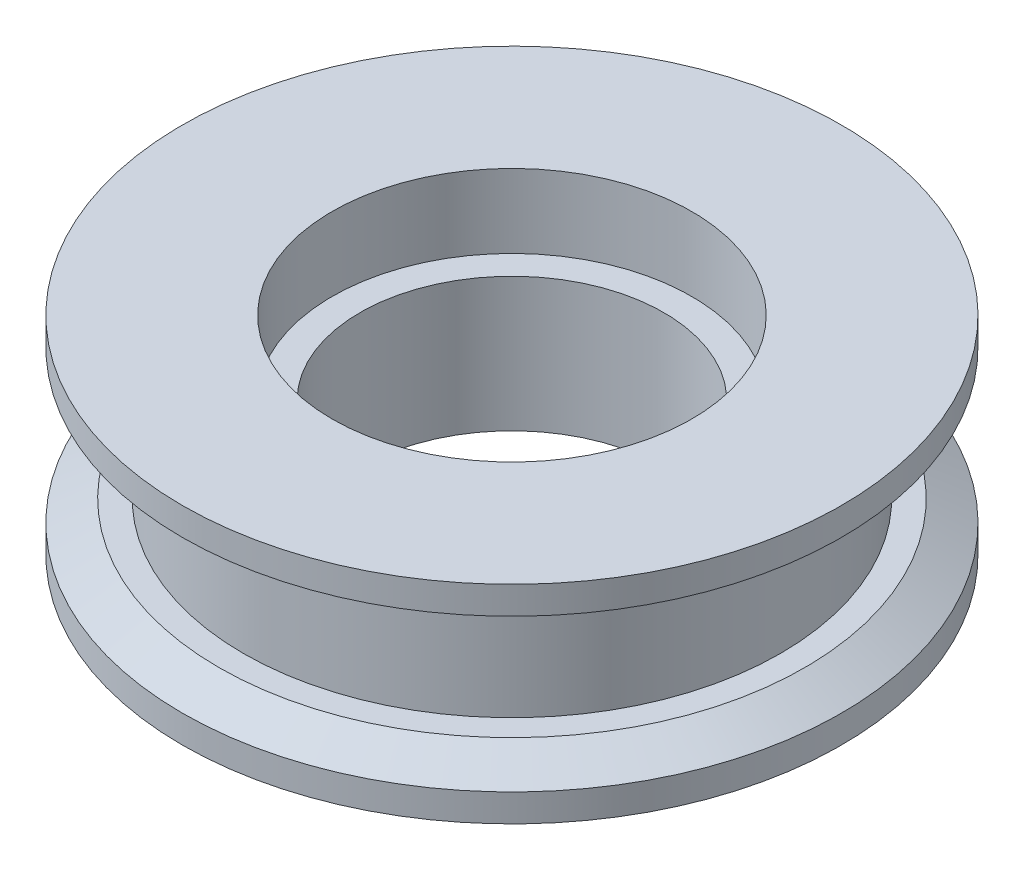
ISO-10303-21;
HEADER;
FILE_DESCRIPTION(('STEP AP214'),'2;1');
FILE_NAME('part.step','',(''),(''),'','','');
FILE_SCHEMA(('AUTOMOTIVE_DESIGN { 1 0 10303 214 1 1 1 1 }'));
ENDSEC;
DATA;
#1=APPLICATION_CONTEXT('core data for automotive mechanical design processes');
#2=APPLICATION_PROTOCOL_DEFINITION('international standard','automotive_design',2000,#1);
#3=PRODUCT_CONTEXT('',#1,'mechanical');
#4=PRODUCT('Part','Part','',(#3));
#5=PRODUCT_RELATED_PRODUCT_CATEGORY('part','',(#4));
#6=PRODUCT_DEFINITION_FORMATION('','',#4);
#7=PRODUCT_DEFINITION_CONTEXT('part definition',#1,'design');
#8=PRODUCT_DEFINITION('design','',#6,#7);
#9=PRODUCT_DEFINITION_SHAPE('','',#8);
#10=(LENGTH_UNIT() NAMED_UNIT(*) SI_UNIT(.MILLI.,.METRE.));
#11=(NAMED_UNIT(*) PLANE_ANGLE_UNIT() SI_UNIT($,.RADIAN.));
#12=(NAMED_UNIT(*) SI_UNIT($,.STERADIAN.) SOLID_ANGLE_UNIT());
#13=UNCERTAINTY_MEASURE_WITH_UNIT(LENGTH_MEASURE(1.E-05),#10,'distance_accuracy_value','');
#14=(GEOMETRIC_REPRESENTATION_CONTEXT(3) GLOBAL_UNCERTAINTY_ASSIGNED_CONTEXT((#13)) GLOBAL_UNIT_ASSIGNED_CONTEXT((#10,
#11,#12)) REPRESENTATION_CONTEXT('',''));
#15=CARTESIAN_POINT('',(0.,0.,0.));
#16=DIRECTION('',(0.,0.,1.));
#17=DIRECTION('',(1.,0.,0.));
#18=AXIS2_PLACEMENT_3D('',#15,#16,#17);
#19=CARTESIAN_POINT('',(409.,-812.8,-284.));
#20=DIRECTION('',(0.,1.,0.));
#21=DIRECTION('',(0.,0.,1.));
#22=AXIS2_PLACEMENT_3D('',#19,#20,#21);
#23=CYLINDRICAL_SURFACE('',#22,6.22299999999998);
#24=CARTESIAN_POINT('',(409.,8.00000000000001,-284.));
#25=DIRECTION('',(0.,1.,0.));
#26=DIRECTION('',(0.,0.,1.));
#27=AXIS2_PLACEMENT_3D('',#24,#25,#26);
#28=CIRCLE('',#27,6.22299999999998);
#29=CARTESIAN_POINT('',(409.,8.00000000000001,-277.777));
#30=VERTEX_POINT('',#29);
#31=EDGE_CURVE('E60',#30,#30,#28,.T.);
#32=ORIENTED_EDGE('',*,*,#31,.F.);
#33=EDGE_LOOP('',(#32));
#34=FACE_BOUND('',#33,.T.);
#35=CARTESIAN_POINT('',(409.,13.4840000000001,-284.));
#36=DIRECTION('',(0.,1.,0.));
#37=DIRECTION('',(0.,0.,1.));
#38=AXIS2_PLACEMENT_3D('',#35,#36,#37);
#39=CIRCLE('',#38,6.22299999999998);
#40=CARTESIAN_POINT('',(409.,13.4840000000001,-277.777));
#41=VERTEX_POINT('',#40);
#42=EDGE_CURVE('E32',#41,#41,#39,.F.);
#43=ORIENTED_EDGE('',*,*,#42,.F.);
#44=EDGE_LOOP('',(#43));
#45=FACE_BOUND('',#44,.T.);
#46=ADVANCED_FACE('F28',(#34,#45),#23,.F.);
#47=CARTESIAN_POINT('',(409.,10.,-284.));
#48=DIRECTION('',(0.,1.,0.));
#49=DIRECTION('',(0.,0.,1.));
#50=AXIS2_PLACEMENT_3D('',#47,#48,#49);
#51=PLANE('',#50);
#52=CARTESIAN_POINT('',(409.,10.,-284.));
#53=DIRECTION('',(0.,1.,0.));
#54=DIRECTION('',(0.,0.,1.));
#55=AXIS2_PLACEMENT_3D('',#52,#53,#54);
#56=CIRCLE('',#55,12.);
#57=CARTESIAN_POINT('',(409.,10.,-272.));
#58=VERTEX_POINT('',#57);
#59=EDGE_CURVE('E45',#58,#58,#56,.T.);
#60=ORIENTED_EDGE('',*,*,#59,.T.);
#61=EDGE_LOOP('',(#60));
#62=FACE_BOUND('',#61,.T.);
#63=CARTESIAN_POINT('',(409.,10.,-284.));
#64=DIRECTION('',(0.,1.,0.));
#65=DIRECTION('',(0.,0.,1.));
#66=AXIS2_PLACEMENT_3D('',#63,#64,#65);
#67=CIRCLE('',#66,11.);
#68=CARTESIAN_POINT('',(409.,10.,-273.));
#69=VERTEX_POINT('',#68);
#70=EDGE_CURVE('E52',#69,#69,#67,.T.);
#71=ORIENTED_EDGE('',*,*,#70,.F.);
#72=EDGE_LOOP('',(#71));
#73=FACE_BOUND('',#72,.T.);
#74=ADVANCED_FACE('F92',(#62,#73),#51,.T.);
#75=CARTESIAN_POINT('',(409.,10.,-284.));
#76=DIRECTION('',(0.,-1.,0.));
#77=DIRECTION('',(0.,0.,-1.));
#78=AXIS2_PLACEMENT_3D('',#75,#76,#77);
#79=CYLINDRICAL_SURFACE('',#78,13.5);
#80=CARTESIAN_POINT('',(409.,9.13397459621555,-284.));
#81=DIRECTION('',(0.,1.,0.));
#82=DIRECTION('',(0.,0.,1.));
#83=AXIS2_PLACEMENT_3D('',#80,#81,#82);
#84=CIRCLE('',#83,13.5);
#85=CARTESIAN_POINT('',(409.,9.13397459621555,-270.5));
#86=VERTEX_POINT('',#85);
#87=EDGE_CURVE('E40',#86,#86,#84,.F.);
#88=ORIENTED_EDGE('',*,*,#87,.T.);
#89=EDGE_LOOP('',(#88));
#90=FACE_BOUND('',#89,.T.);
#91=CARTESIAN_POINT('',(409.,8.,-284.));
#92=DIRECTION('',(0.,1.,0.));
#93=DIRECTION('',(0.,0.,1.));
#94=AXIS2_PLACEMENT_3D('',#91,#92,#93);
#95=CIRCLE('',#94,13.5);
#96=CARTESIAN_POINT('',(409.,8.,-270.5));
#97=VERTEX_POINT('',#96);
#98=EDGE_CURVE('E48',#97,#97,#95,.T.);
#99=ORIENTED_EDGE('',*,*,#98,.T.);
#100=EDGE_LOOP('',(#99));
#101=FACE_BOUND('',#100,.T.);
#102=ADVANCED_FACE('F99',(#90,#101),#79,.T.);
#103=CARTESIAN_POINT('',(409.,8.,-284.));
#104=DIRECTION('',(0.,1.,0.));
#105=DIRECTION('',(0.,0.,1.));
#106=AXIS2_PLACEMENT_3D('',#103,#104,#105);
#107=PLANE('',#106);
#108=ORIENTED_EDGE('',*,*,#31,.T.);
#109=EDGE_LOOP('',(#108));
#110=FACE_BOUND('',#109,.T.);
#111=ORIENTED_EDGE('',*,*,#98,.F.);
#112=EDGE_LOOP('',(#111));
#113=FACE_BOUND('',#112,.T.);
#114=ADVANCED_FACE('F135',(#110,#113),#107,.F.);
#115=CARTESIAN_POINT('',(409.,14.5,-284.));
#116=DIRECTION('',(0.,-1.,0.));
#117=DIRECTION('',(0.,0.,-1.));
#118=AXIS2_PLACEMENT_3D('',#115,#116,#117);
#119=CYLINDRICAL_SURFACE('',#118,11.);
#120=CARTESIAN_POINT('',(409.,14.5,-284.));
#121=DIRECTION('',(0.,1.,0.));
#122=DIRECTION('',(0.,0.,1.));
#123=AXIS2_PLACEMENT_3D('',#120,#121,#122);
#124=CIRCLE('',#123,11.);
#125=CARTESIAN_POINT('',(409.,14.5,-273.));
#126=VERTEX_POINT('',#125);
#127=EDGE_CURVE('E51',#126,#126,#124,.T.);
#128=ORIENTED_EDGE('',*,*,#127,.F.);
#129=EDGE_LOOP('',(#128));
#130=FACE_BOUND('',#129,.T.);
#131=ORIENTED_EDGE('',*,*,#70,.T.);
#132=EDGE_LOOP('',(#131));
#133=FACE_BOUND('',#132,.T.);
#134=ADVANCED_FACE('F88',(#130,#133),#119,.T.);
#135=CARTESIAN_POINT('',(409.,14.5,-284.));
#136=DIRECTION('',(0.,1.,0.));
#137=DIRECTION('',(0.,0.,1.));
#138=AXIS2_PLACEMENT_3D('',#135,#136,#137);
#139=PLANE('',#138);
#140=CARTESIAN_POINT('',(409.,14.5,-284.));
#141=DIRECTION('',(0.,1.,0.));
#142=DIRECTION('',(0.,0.,1.));
#143=AXIS2_PLACEMENT_3D('',#140,#141,#142);
#144=CIRCLE('',#143,12.);
#145=CARTESIAN_POINT('',(409.,14.5,-272.));
#146=VERTEX_POINT('',#145);
#147=EDGE_CURVE('E10',#146,#146,#144,.F.);
#148=ORIENTED_EDGE('',*,*,#147,.T.);
#149=EDGE_LOOP('',(#148));
#150=FACE_BOUND('',#149,.T.);
#151=ORIENTED_EDGE('',*,*,#127,.T.);
#152=EDGE_LOOP('',(#151));
#153=FACE_BOUND('',#152,.T.);
#154=ADVANCED_FACE('F81',(#150,#153),#139,.F.);
#155=CARTESIAN_POINT('',(409.,16.5,-284.));
#156=DIRECTION('',(0.,-1.,0.));
#157=DIRECTION('',(0.,0.,-1.));
#158=AXIS2_PLACEMENT_3D('',#155,#156,#157);
#159=CYLINDRICAL_SURFACE('',#158,13.5);
#160=CARTESIAN_POINT('',(409.,15.3660254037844,-284.));
#161=DIRECTION('',(0.,1.,0.));
#162=DIRECTION('',(0.,0.,1.));
#163=AXIS2_PLACEMENT_3D('',#160,#161,#162);
#164=CIRCLE('',#163,13.5);
#165=CARTESIAN_POINT('',(409.,15.3660254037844,-270.5));
#166=VERTEX_POINT('',#165);
#167=EDGE_CURVE('E36',#166,#166,#164,.T.);
#168=ORIENTED_EDGE('',*,*,#167,.T.);
#169=EDGE_LOOP('',(#168));
#170=FACE_BOUND('',#169,.T.);
#171=CARTESIAN_POINT('',(409.,16.5,-284.));
#172=DIRECTION('',(0.,1.,0.));
#173=DIRECTION('',(0.,0.,1.));
#174=AXIS2_PLACEMENT_3D('',#171,#172,#173);
#175=CIRCLE('',#174,13.5);
#176=CARTESIAN_POINT('',(409.,16.5,-270.5));
#177=VERTEX_POINT('',#176);
#178=EDGE_CURVE('E55',#177,#177,#175,.T.);
#179=ORIENTED_EDGE('',*,*,#178,.F.);
#180=EDGE_LOOP('',(#179));
#181=FACE_BOUND('',#180,.T.);
#182=ADVANCED_FACE('F76',(#170,#181),#159,.T.);
#183=CARTESIAN_POINT('',(409.,16.5,-284.));
#184=DIRECTION('',(0.,1.,0.));
#185=DIRECTION('',(0.,0.,1.));
#186=AXIS2_PLACEMENT_3D('',#183,#184,#185);
#187=PLANE('',#186);
#188=CARTESIAN_POINT('',(409.,16.5,-284.));
#189=DIRECTION('',(0.,1.,0.));
#190=DIRECTION('',(0.,0.,1.));
#191=AXIS2_PLACEMENT_3D('',#188,#189,#190);
#192=CIRCLE('',#191,7.36599999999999);
#193=CARTESIAN_POINT('',(409.,16.5,-276.634));
#194=VERTEX_POINT('',#193);
#195=EDGE_CURVE('E66',#194,#194,#192,.T.);
#196=ORIENTED_EDGE('',*,*,#195,.F.);
#197=EDGE_LOOP('',(#196));
#198=FACE_BOUND('',#197,.T.);
#199=ORIENTED_EDGE('',*,*,#178,.T.);
#200=EDGE_LOOP('',(#199));
#201=FACE_BOUND('',#200,.T.);
#202=ADVANCED_FACE('F72',(#198,#201),#187,.T.);
#203=CARTESIAN_POINT('',(409.,10.,-284.));
#204=DIRECTION('',(0.,-1.,0.));
#205=DIRECTION('',(0.,0.,-1.));
#206=AXIS2_PLACEMENT_3D('',#203,#204,#205);
#207=CONICAL_SURFACE('',#206,12.,1.04719755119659);
#208=ORIENTED_EDGE('',*,*,#87,.F.);
#209=EDGE_LOOP('',(#208));
#210=FACE_BOUND('',#209,.T.);
#211=ORIENTED_EDGE('',*,*,#59,.F.);
#212=EDGE_LOOP('',(#211));
#213=FACE_BOUND('',#212,.T.);
#214=ADVANCED_FACE('F75',(#210,#213),#207,.T.);
#215=CARTESIAN_POINT('',(409.,15.3660254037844,-284.));
#216=DIRECTION('',(0.,1.,0.));
#217=DIRECTION('',(0.,0.,1.));
#218=AXIS2_PLACEMENT_3D('',#215,#216,#217);
#219=CONICAL_SURFACE('',#218,13.5,1.04719755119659);
#220=CARTESIAN_POINT('',(409.,14.5,-272.));
#221=CARTESIAN_POINT('',(409.,14.5090210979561,-271.984375));
#222=CARTESIAN_POINT('',(409.,14.5180421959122,-271.96875));
#223=CARTESIAN_POINT('',(409.,14.5360843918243,-271.9375));
#224=CARTESIAN_POINT('',(409.,14.5451054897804,-271.921875));
#225=CARTESIAN_POINT('',(409.,14.5631476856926,-271.890625));
#226=CARTESIAN_POINT('',(409.,14.5721687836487,-271.875));
#227=CARTESIAN_POINT('',(409.,14.5902109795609,-271.84375));
#228=CARTESIAN_POINT('',(409.,14.599232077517,-271.828125));
#229=CARTESIAN_POINT('',(409.,14.6172742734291,-271.796875));
#230=CARTESIAN_POINT('',(409.,14.6262953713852,-271.78125));
#231=CARTESIAN_POINT('',(409.,14.6443375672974,-271.75));
#232=CARTESIAN_POINT('',(409.,14.6533586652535,-271.734375));
#233=CARTESIAN_POINT('',(409.,14.6714008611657,-271.703125));
#234=CARTESIAN_POINT('',(409.,14.6804219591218,-271.6875));
#235=CARTESIAN_POINT('',(409.,14.6984641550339,-271.65625));
#236=CARTESIAN_POINT('',(409.,14.70748525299,-271.640625));
#237=CARTESIAN_POINT('',(409.,14.7255274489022,-271.609375));
#238=CARTESIAN_POINT('',(409.,14.7345485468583,-271.59375));
#239=CARTESIAN_POINT('',(409.,14.7525907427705,-271.5625));
#240=CARTESIAN_POINT('',(409.,14.7616118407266,-271.546875));
#241=CARTESIAN_POINT('',(409.,14.7796540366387,-271.515625));
#242=CARTESIAN_POINT('',(409.,14.7886751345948,-271.5));
#243=CARTESIAN_POINT('',(409.,14.806717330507,-271.46875));
#244=CARTESIAN_POINT('',(409.,14.8157384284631,-271.453125));
#245=CARTESIAN_POINT('',(409.,14.8337806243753,-271.421875));
#246=CARTESIAN_POINT('',(409.,14.8428017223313,-271.40625));
#247=CARTESIAN_POINT('',(409.,14.8608439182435,-271.375));
#248=CARTESIAN_POINT('',(409.,14.8698650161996,-271.359375));
#249=CARTESIAN_POINT('',(409.,14.8879072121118,-271.328125));
#250=CARTESIAN_POINT('',(409.,14.8969283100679,-271.3125));
#251=CARTESIAN_POINT('',(409.,14.91497050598,-271.28125));
#252=CARTESIAN_POINT('',(409.,14.9239916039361,-271.265625));
#253=CARTESIAN_POINT('',(409.,14.9420337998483,-271.234375));
#254=CARTESIAN_POINT('',(409.,14.9510548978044,-271.21875));
#255=CARTESIAN_POINT('',(409.,14.9690970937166,-271.1875));
#256=CARTESIAN_POINT('',(409.,14.9781181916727,-271.171875));
#257=CARTESIAN_POINT('',(409.,14.9961603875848,-271.140625));
#258=CARTESIAN_POINT('',(409.,15.0051814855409,-271.125));
#259=CARTESIAN_POINT('',(409.,15.0232236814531,-271.09375));
#260=CARTESIAN_POINT('',(409.,15.0322447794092,-271.078125));
#261=CARTESIAN_POINT('',(409.,15.0502869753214,-271.046875));
#262=CARTESIAN_POINT('',(409.,15.0593080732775,-271.03125));
#263=CARTESIAN_POINT('',(409.,15.0773502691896,-271.));
#264=CARTESIAN_POINT('',(409.,15.0863713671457,-270.984375));
#265=CARTESIAN_POINT('',(409.,15.1044135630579,-270.953125));
#266=CARTESIAN_POINT('',(409.,15.113434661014,-270.9375));
#267=CARTESIAN_POINT('',(409.,15.1314768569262,-270.90625));
#268=CARTESIAN_POINT('',(409.,15.1404979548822,-270.890625));
#269=CARTESIAN_POINT('',(409.,15.1585401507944,-270.859375));
#270=CARTESIAN_POINT('',(409.,15.1675612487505,-270.84375));
#271=CARTESIAN_POINT('',(409.,15.1856034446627,-270.8125));
#272=CARTESIAN_POINT('',(409.,15.1946245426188,-270.796875));
#273=CARTESIAN_POINT('',(409.,15.212666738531,-270.765625));
#274=CARTESIAN_POINT('',(409.,15.221687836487,-270.75));
#275=CARTESIAN_POINT('',(409.,15.2397300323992,-270.71875));
#276=CARTESIAN_POINT('',(409.,15.2487511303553,-270.703125));
#277=CARTESIAN_POINT('',(409.,15.2667933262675,-270.671875));
#278=CARTESIAN_POINT('',(409.,15.2758144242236,-270.65625));
#279=CARTESIAN_POINT('',(409.,15.2938566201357,-270.625));
#280=CARTESIAN_POINT('',(409.,15.3028777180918,-270.609375));
#281=CARTESIAN_POINT('',(409.,15.320919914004,-270.578125));
#282=CARTESIAN_POINT('',(409.,15.3299410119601,-270.5625));
#283=CARTESIAN_POINT('',(409.,15.3479832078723,-270.53125));
#284=CARTESIAN_POINT('',(409.,15.3570043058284,-270.515625));
#285=CARTESIAN_POINT('',(409.,15.3660254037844,-270.5));
#286=B_SPLINE_CURVE_WITH_KNOTS('',3,(#220,#221,#222,#223,#224,#225,#226,#227,#228,#229,#230,
#231,#232,#233,#234,#235,#236,#237,#238,#239,#240,#241,#242,#243,#244,#245,#246,#247,#248,#249,
#250,#251,#252,#253,#254,#255,#256,#257,#258,#259,#260,#261,#262,#263,#264,#265,#266,#267,#268,
#269,#270,#271,#272,#273,#274,#275,#276,#277,#278,#279,#280,#281,#282,#283,#284,#285),
.UNSPECIFIED.,.F.,.F.,(4,2,2,2,2,2,2,2,2,2,2,2,2,2,2,2,2,2,2,2,2,2,2,2,2,2,2,2,2,2,2,2,4),(0.,
0.0541265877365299,0.108253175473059,0.162379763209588,0.216506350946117,0.270632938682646,
0.324759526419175,0.378886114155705,0.433012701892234,0.487139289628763,0.541265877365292,
0.595392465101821,0.64951905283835,0.70364564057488,0.757772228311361,0.81189881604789,
0.866025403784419,0.920151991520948,0.974278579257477,1.02840516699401,1.08253175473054,
1.13665834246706,1.19078493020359,1.24491151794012,1.29903810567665,1.35316469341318,
1.40729128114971,1.46141786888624,1.51554445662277,1.5696710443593,1.62379763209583,
1.67792421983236,1.73205080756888),.UNSPECIFIED.);
#287=EDGE_CURVE('BSEAM30',#146,#166,#286,.T.);
#288=ORIENTED_EDGE('',*,*,#147,.F.);
#289=ORIENTED_EDGE('',*,*,#167,.F.);
#290=ORIENTED_EDGE('',*,*,#287,.T.);
#291=ORIENTED_EDGE('',*,*,#287,.F.);
#292=EDGE_LOOP('',(#288,#290,#289,#291));
#293=FACE_BOUND('',#292,.T.);
#294=ADVANCED_FACE('F30',(#293),#219,.T.);
#295=CARTESIAN_POINT('',(-30.,13.484,286.));
#296=DIRECTION('',(0.,1.,0.));
#297=DIRECTION('',(0.,0.,1.));
#298=AXIS2_PLACEMENT_3D('',#295,#296,#297);
#299=PLANE('',#298);
#300=CARTESIAN_POINT('',(409.,13.484,-284.));
#301=DIRECTION('',(0.,1.,0.));
#302=DIRECTION('',(0.,0.,1.));
#303=AXIS2_PLACEMENT_3D('',#300,#301,#302);
#304=CIRCLE('',#303,7.36599999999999);
#305=CARTESIAN_POINT('',(409.,13.484,-276.634));
#306=VERTEX_POINT('',#305);
#307=EDGE_CURVE('E63',#306,#306,#304,.F.);
#308=ORIENTED_EDGE('',*,*,#307,.F.);
#309=EDGE_LOOP('',(#308));
#310=FACE_BOUND('',#309,.T.);
#311=ORIENTED_EDGE('',*,*,#42,.T.);
#312=EDGE_LOOP('',(#311));
#313=FACE_BOUND('',#312,.T.);
#314=ADVANCED_FACE('F107',(#310,#313),#299,.T.);
#315=CARTESIAN_POINT('',(409.,-8.3661942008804,-284.));
#316=DIRECTION('',(0.,1.,0.));
#317=DIRECTION('',(0.,0.,1.));
#318=AXIS2_PLACEMENT_3D('',#315,#316,#317);
#319=CYLINDRICAL_SURFACE('',#318,7.36599999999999);
#320=CARTESIAN_POINT('',(409.,13.484,-276.634));
#321=CARTESIAN_POINT('',(409.,13.5154166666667,-276.634));
#322=CARTESIAN_POINT('',(409.,13.5468333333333,-276.634));
#323=CARTESIAN_POINT('',(409.,13.6096666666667,-276.634));
#324=CARTESIAN_POINT('',(409.,13.6410833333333,-276.634));
#325=CARTESIAN_POINT('',(409.,13.7039166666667,-276.634));
#326=CARTESIAN_POINT('',(409.,13.7353333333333,-276.634));
#327=CARTESIAN_POINT('',(409.,13.7981666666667,-276.634));
#328=CARTESIAN_POINT('',(409.,13.8295833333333,-276.634));
#329=CARTESIAN_POINT('',(409.,13.8924166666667,-276.634));
#330=CARTESIAN_POINT('',(409.,13.9238333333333,-276.634));
#331=CARTESIAN_POINT('',(409.,13.9866666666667,-276.634));
#332=CARTESIAN_POINT('',(409.,14.0180833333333,-276.634));
#333=CARTESIAN_POINT('',(409.,14.0809166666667,-276.634));
#334=CARTESIAN_POINT('',(409.,14.1123333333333,-276.634));
#335=CARTESIAN_POINT('',(409.,14.1751666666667,-276.634));
#336=CARTESIAN_POINT('',(409.,14.2065833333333,-276.634));
#337=CARTESIAN_POINT('',(409.,14.2694166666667,-276.634));
#338=CARTESIAN_POINT('',(409.,14.3008333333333,-276.634));
#339=CARTESIAN_POINT('',(409.,14.3636666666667,-276.634));
#340=CARTESIAN_POINT('',(409.,14.3950833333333,-276.634));
#341=CARTESIAN_POINT('',(409.,14.4579166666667,-276.634));
#342=CARTESIAN_POINT('',(409.,14.4893333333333,-276.634));
#343=CARTESIAN_POINT('',(409.,14.5521666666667,-276.634));
#344=CARTESIAN_POINT('',(409.,14.5835833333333,-276.634));
#345=CARTESIAN_POINT('',(409.,14.6464166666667,-276.634));
#346=CARTESIAN_POINT('',(409.,14.6778333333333,-276.634));
#347=CARTESIAN_POINT('',(409.,14.7406666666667,-276.634));
#348=CARTESIAN_POINT('',(409.,14.7720833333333,-276.634));
#349=CARTESIAN_POINT('',(409.,14.8349166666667,-276.634));
#350=CARTESIAN_POINT('',(409.,14.8663333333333,-276.634));
#351=CARTESIAN_POINT('',(409.,14.9291666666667,-276.634));
#352=CARTESIAN_POINT('',(409.,14.9605833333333,-276.634));
#353=CARTESIAN_POINT('',(409.,15.0234166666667,-276.634));
#354=CARTESIAN_POINT('',(409.,15.0548333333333,-276.634));
#355=CARTESIAN_POINT('',(409.,15.1176666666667,-276.634));
#356=CARTESIAN_POINT('',(409.,15.1490833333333,-276.634));
#357=CARTESIAN_POINT('',(409.,15.2119166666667,-276.634));
#358=CARTESIAN_POINT('',(409.,15.2433333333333,-276.634));
#359=CARTESIAN_POINT('',(409.,15.3061666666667,-276.634));
#360=CARTESIAN_POINT('',(409.,15.3375833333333,-276.634));
#361=CARTESIAN_POINT('',(409.,15.4004166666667,-276.634));
#362=CARTESIAN_POINT('',(409.,15.4318333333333,-276.634));
#363=CARTESIAN_POINT('',(409.,15.4946666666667,-276.634));
#364=CARTESIAN_POINT('',(409.,15.5260833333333,-276.634));
#365=CARTESIAN_POINT('',(409.,15.5889166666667,-276.634));
#366=CARTESIAN_POINT('',(409.,15.6203333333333,-276.634));
#367=CARTESIAN_POINT('',(409.,15.6831666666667,-276.634));
#368=CARTESIAN_POINT('',(409.,15.7145833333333,-276.634));
#369=CARTESIAN_POINT('',(409.,15.7774166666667,-276.634));
#370=CARTESIAN_POINT('',(409.,15.8088333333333,-276.634));
#371=CARTESIAN_POINT('',(409.,15.8716666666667,-276.634));
#372=CARTESIAN_POINT('',(409.,15.9030833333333,-276.634));
#373=CARTESIAN_POINT('',(409.,15.9659166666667,-276.634));
#374=CARTESIAN_POINT('',(409.,15.9973333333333,-276.634));
#375=CARTESIAN_POINT('',(409.,16.0601666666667,-276.634));
#376=CARTESIAN_POINT('',(409.,16.0915833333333,-276.634));
#377=CARTESIAN_POINT('',(409.,16.1544166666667,-276.634));
#378=CARTESIAN_POINT('',(409.,16.1858333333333,-276.634));
#379=CARTESIAN_POINT('',(409.,16.2486666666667,-276.634));
#380=CARTESIAN_POINT('',(409.,16.2800833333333,-276.634));
#381=CARTESIAN_POINT('',(409.,16.3429166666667,-276.634));
#382=CARTESIAN_POINT('',(409.,16.3743333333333,-276.634));
#383=CARTESIAN_POINT('',(409.,16.4371666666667,-276.634));
#384=CARTESIAN_POINT('',(409.,16.4685833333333,-276.634));
#385=CARTESIAN_POINT('',(409.,16.5,-276.634));
#386=B_SPLINE_CURVE_WITH_KNOTS('',3,(#320,#321,#322,#323,#324,#325,#326,#327,#328,#329,#330,
#331,#332,#333,#334,#335,#336,#337,#338,#339,#340,#341,#342,#343,#344,#345,#346,#347,#348,#349,
#350,#351,#352,#353,#354,#355,#356,#357,#358,#359,#360,#361,#362,#363,#364,#365,#366,#367,#368,
#369,#370,#371,#372,#373,#374,#375,#376,#377,#378,#379,#380,#381,#382,#383,#384,#385),
.UNSPECIFIED.,.F.,.F.,(4,2,2,2,2,2,2,2,2,2,2,2,2,2,2,2,2,2,2,2,2,2,2,2,2,2,2,2,2,2,2,2,4),(0.,
0.0942500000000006,0.188500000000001,0.282750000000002,0.377000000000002,0.471249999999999,
0.5655,0.659750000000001,0.754000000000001,0.848250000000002,0.942500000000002,1.03675,1.131,
1.22525,1.3195,1.41375,1.508,1.60225,1.6965,1.79075,1.885,1.97925,2.0735,2.16775,2.262,2.35625,
2.4505,2.54475000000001,2.639,2.73325,2.8275,2.92175,3.016),.UNSPECIFIED.);
#387=EDGE_CURVE('BSEAM70',#306,#194,#386,.T.);
#388=ORIENTED_EDGE('',*,*,#307,.T.);
#389=ORIENTED_EDGE('',*,*,#195,.T.);
#390=ORIENTED_EDGE('',*,*,#387,.T.);
#391=ORIENTED_EDGE('',*,*,#387,.F.);
#392=EDGE_LOOP('',(#388,#390,#389,#391));
#393=FACE_BOUND('',#392,.T.);
#394=ADVANCED_FACE('F70',(#393),#319,.F.);
#395=CLOSED_SHELL('',(#46,#74,#102,#114,#134,#154,#182,#202,#214,#294,#314,#394));
#396=MANIFOLD_SOLID_BREP('B2',#395);
#397=ADVANCED_BREP_SHAPE_REPRESENTATION('',(#18,#396),#14);
#398=SHAPE_DEFINITION_REPRESENTATION(#9,#397);
ENDSEC;
END-ISO-10303-21;
